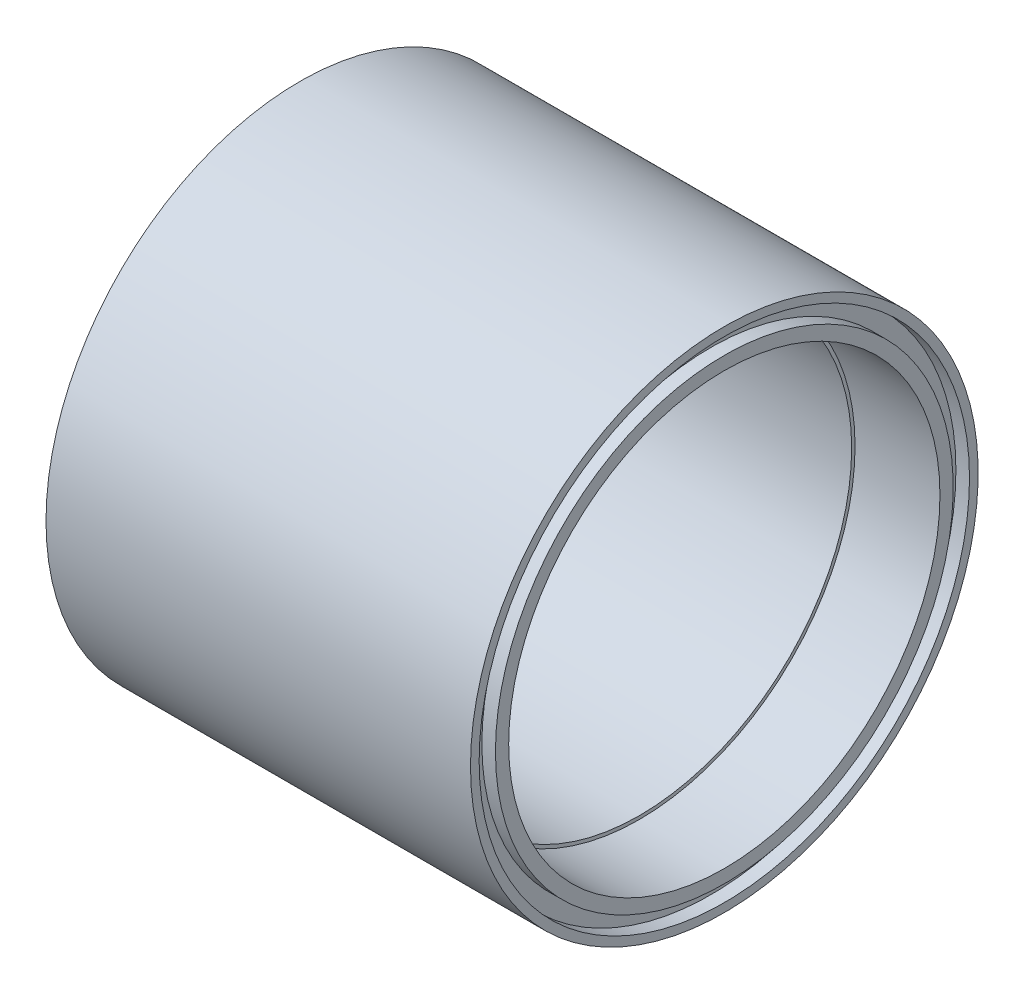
ISO-10303-21;
HEADER;
FILE_DESCRIPTION(('STEP AP214'),'2;1');
FILE_NAME('part.step','',(''),(''),'','','');
FILE_SCHEMA(('AUTOMOTIVE_DESIGN { 1 0 10303 214 1 1 1 1 }'));
ENDSEC;
DATA;
#1=APPLICATION_CONTEXT('core data for automotive mechanical design processes');
#2=APPLICATION_PROTOCOL_DEFINITION('international standard','automotive_design',2000,#1);
#3=PRODUCT_CONTEXT('',#1,'mechanical');
#4=PRODUCT('Part','Part','',(#3));
#5=PRODUCT_RELATED_PRODUCT_CATEGORY('part','',(#4));
#6=PRODUCT_DEFINITION_FORMATION('','',#4);
#7=PRODUCT_DEFINITION_CONTEXT('part definition',#1,'design');
#8=PRODUCT_DEFINITION('design','',#6,#7);
#9=PRODUCT_DEFINITION_SHAPE('','',#8);
#10=(LENGTH_UNIT() NAMED_UNIT(*) SI_UNIT(.MILLI.,.METRE.));
#11=(NAMED_UNIT(*) PLANE_ANGLE_UNIT() SI_UNIT($,.RADIAN.));
#12=(NAMED_UNIT(*) SI_UNIT($,.STERADIAN.) SOLID_ANGLE_UNIT());
#13=UNCERTAINTY_MEASURE_WITH_UNIT(LENGTH_MEASURE(1.E-05),#10,'distance_accuracy_value','');
#14=(GEOMETRIC_REPRESENTATION_CONTEXT(3) GLOBAL_UNCERTAINTY_ASSIGNED_CONTEXT((#13)) GLOBAL_UNIT_ASSIGNED_CONTEXT((#10,
#11,#12)) REPRESENTATION_CONTEXT('',''));
#15=CARTESIAN_POINT('',(0.,0.,0.));
#16=DIRECTION('',(0.,0.,1.));
#17=DIRECTION('',(1.,0.,0.));
#18=AXIS2_PLACEMENT_3D('',#15,#16,#17);
#19=CARTESIAN_POINT('',(31.75,32.258,0.));
#20=DIRECTION('',(-1.,0.,0.));
#21=DIRECTION('',(0.,0.,1.));
#22=AXIS2_PLACEMENT_3D('',#19,#20,#21);
#23=PLANE('',#22);
#24=CARTESIAN_POINT('',(31.75,0.,0.));
#25=DIRECTION('',(-1.,0.,0.));
#26=DIRECTION('',(0.,0.,1.));
#27=AXIS2_PLACEMENT_3D('',#24,#25,#26);
#28=CIRCLE('',#27,32.258);
#29=CARTESIAN_POINT('',(31.75,0.,32.258));
#30=VERTEX_POINT('',#29);
#31=EDGE_CURVE('E49',#30,#30,#28,.T.);
#32=ORIENTED_EDGE('',*,*,#31,.T.);
#33=EDGE_LOOP('',(#32));
#34=FACE_BOUND('',#33,.T.);
#35=CARTESIAN_POINT('',(31.75,0.,0.));
#36=DIRECTION('',(-1.,0.,0.));
#37=DIRECTION('',(0.,0.,1.));
#38=AXIS2_PLACEMENT_3D('',#35,#36,#37);
#39=CIRCLE('',#38,34.2392);
#40=CARTESIAN_POINT('',(31.75,0.,34.2392));
#41=VERTEX_POINT('',#40);
#42=EDGE_CURVE('E85',#41,#41,#39,.T.);
#43=ORIENTED_EDGE('',*,*,#42,.F.);
#44=EDGE_LOOP('',(#43));
#45=FACE_BOUND('',#44,.T.);
#46=ADVANCED_FACE('F34',(#34,#45),#23,.F.);
#47=CARTESIAN_POINT('',(-31.75,37.973,0.));
#48=DIRECTION('',(1.,0.,0.));
#49=DIRECTION('',(0.,0.,-1.));
#50=AXIS2_PLACEMENT_3D('',#47,#48,#49);
#51=PLANE('',#50);
#52=CARTESIAN_POINT('',(-31.75,0.,0.));
#53=DIRECTION('',(-1.,0.,0.));
#54=DIRECTION('',(0.,0.,1.));
#55=AXIS2_PLACEMENT_3D('',#52,#53,#54);
#56=CIRCLE('',#55,32.258);
#57=CARTESIAN_POINT('',(-31.75,0.,32.258));
#58=VERTEX_POINT('',#57);
#59=EDGE_CURVE('E10',#58,#58,#56,.T.);
#60=ORIENTED_EDGE('',*,*,#59,.F.);
#61=EDGE_LOOP('',(#60));
#62=FACE_BOUND('',#61,.T.);
#63=CARTESIAN_POINT('',(-31.75,0.,0.));
#64=DIRECTION('',(-1.,0.,0.));
#65=DIRECTION('',(0.,0.,1.));
#66=AXIS2_PLACEMENT_3D('',#63,#64,#65);
#67=CIRCLE('',#66,34.2392);
#68=CARTESIAN_POINT('',(-31.75,0.,34.2392));
#69=VERTEX_POINT('',#68);
#70=EDGE_CURVE('E73',#69,#69,#67,.T.);
#71=ORIENTED_EDGE('',*,*,#70,.T.);
#72=EDGE_LOOP('',(#71));
#73=FACE_BOUND('',#72,.T.);
#74=ADVANCED_FACE('F101',(#62,#73),#51,.F.);
#75=CARTESIAN_POINT('',(0.,0.,0.));
#76=DIRECTION('',(-1.,0.,0.));
#77=DIRECTION('',(0.,0.,1.));
#78=AXIS2_PLACEMENT_3D('',#75,#76,#77);
#79=CYLINDRICAL_SURFACE('',#78,32.258);
#80=CARTESIAN_POINT('',(-19.05,0.,0.));
#81=DIRECTION('',(-1.,0.,0.));
#82=DIRECTION('',(0.,0.,1.));
#83=AXIS2_PLACEMENT_3D('',#80,#81,#82);
#84=CIRCLE('',#83,32.258);
#85=CARTESIAN_POINT('',(-19.05,0.,32.258));
#86=VERTEX_POINT('',#85);
#87=EDGE_CURVE('E63',#86,#86,#84,.T.);
#88=ORIENTED_EDGE('',*,*,#87,.F.);
#89=EDGE_LOOP('',(#88));
#90=FACE_BOUND('',#89,.T.);
#91=ORIENTED_EDGE('',*,*,#59,.T.);
#92=EDGE_LOOP('',(#91));
#93=FACE_BOUND('',#92,.T.);
#94=ADVANCED_FACE('F36',(#90,#93),#79,.F.);
#95=CARTESIAN_POINT('',(-31.75,0.,0.));
#96=DIRECTION('',(-1.,0.,0.));
#97=DIRECTION('',(0.,0.,1.));
#98=AXIS2_PLACEMENT_3D('',#95,#96,#97);
#99=CIRCLE('',#98,36.6776);
#100=CARTESIAN_POINT('',(-31.75,0.,36.6776));
#101=VERTEX_POINT('',#100);
#102=EDGE_CURVE('E67',#101,#101,#99,.T.);
#103=ORIENTED_EDGE('',*,*,#102,.F.);
#104=EDGE_LOOP('',(#103));
#105=FACE_BOUND('',#104,.T.);
#106=CARTESIAN_POINT('',(-31.75,0.,0.));
#107=DIRECTION('',(-1.,0.,0.));
#108=DIRECTION('',(0.,0.,1.));
#109=AXIS2_PLACEMENT_3D('',#106,#107,#108);
#110=CIRCLE('',#109,37.973);
#111=CARTESIAN_POINT('',(-31.75,0.,37.973));
#112=VERTEX_POINT('',#111);
#113=EDGE_CURVE('E41',#112,#112,#110,.T.);
#114=ORIENTED_EDGE('',*,*,#113,.T.);
#115=EDGE_LOOP('',(#114));
#116=FACE_BOUND('',#115,.T.);
#117=ADVANCED_FACE('F109',(#105,#116),#51,.F.);
#118=CARTESIAN_POINT('',(0.,0.,0.));
#119=DIRECTION('',(-1.,0.,0.));
#120=DIRECTION('',(0.,0.,1.));
#121=AXIS2_PLACEMENT_3D('',#118,#119,#120);
#122=CYLINDRICAL_SURFACE('',#121,37.973);
#123=ORIENTED_EDGE('',*,*,#113,.F.);
#124=EDGE_LOOP('',(#123));
#125=FACE_BOUND('',#124,.T.);
#126=CARTESIAN_POINT('',(31.75,0.,0.));
#127=DIRECTION('',(-1.,0.,0.));
#128=DIRECTION('',(0.,0.,1.));
#129=AXIS2_PLACEMENT_3D('',#126,#127,#128);
#130=CIRCLE('',#129,37.973);
#131=CARTESIAN_POINT('',(31.75,0.,37.973));
#132=VERTEX_POINT('',#131);
#133=EDGE_CURVE('E45',#132,#132,#130,.T.);
#134=ORIENTED_EDGE('',*,*,#133,.T.);
#135=EDGE_LOOP('',(#134));
#136=FACE_BOUND('',#135,.T.);
#137=ADVANCED_FACE('F114',(#125,#136),#122,.T.);
#138=CARTESIAN_POINT('',(31.75,0.,0.));
#139=DIRECTION('',(-1.,0.,0.));
#140=DIRECTION('',(0.,0.,1.));
#141=AXIS2_PLACEMENT_3D('',#138,#139,#140);
#142=CIRCLE('',#141,36.6776);
#143=CARTESIAN_POINT('',(31.75,0.,36.6776));
#144=VERTEX_POINT('',#143);
#145=EDGE_CURVE('E79',#144,#144,#142,.T.);
#146=ORIENTED_EDGE('',*,*,#145,.T.);
#147=EDGE_LOOP('',(#146));
#148=FACE_BOUND('',#147,.T.);
#149=ORIENTED_EDGE('',*,*,#133,.F.);
#150=EDGE_LOOP('',(#149));
#151=FACE_BOUND('',#150,.T.);
#152=ADVANCED_FACE('F104',(#148,#151),#23,.F.);
#153=CARTESIAN_POINT('',(0.,0.,0.));
#154=DIRECTION('',(-1.,0.,0.));
#155=DIRECTION('',(0.,0.,1.));
#156=AXIS2_PLACEMENT_3D('',#153,#154,#155);
#157=CYLINDRICAL_SURFACE('',#156,32.258);
#158=ORIENTED_EDGE('',*,*,#31,.F.);
#159=EDGE_LOOP('',(#158));
#160=FACE_BOUND('',#159,.T.);
#161=CARTESIAN_POINT('',(19.05,0.,0.));
#162=DIRECTION('',(-1.,0.,0.));
#163=DIRECTION('',(0.,0.,1.));
#164=AXIS2_PLACEMENT_3D('',#161,#162,#163);
#165=CIRCLE('',#164,32.258);
#166=CARTESIAN_POINT('',(19.05,0.,32.258));
#167=VERTEX_POINT('',#166);
#168=EDGE_CURVE('E54',#167,#167,#165,.T.);
#169=ORIENTED_EDGE('',*,*,#168,.T.);
#170=EDGE_LOOP('',(#169));
#171=FACE_BOUND('',#170,.T.);
#172=ADVANCED_FACE('F113',(#160,#171),#157,.F.);
#173=CARTESIAN_POINT('',(19.05,31.75,0.));
#174=DIRECTION('',(-1.,0.,0.));
#175=DIRECTION('',(0.,0.,1.));
#176=AXIS2_PLACEMENT_3D('',#173,#174,#175);
#177=PLANE('',#176);
#178=ORIENTED_EDGE('',*,*,#168,.F.);
#179=EDGE_LOOP('',(#178));
#180=FACE_BOUND('',#179,.T.);
#181=CARTESIAN_POINT('',(19.05,0.,0.));
#182=DIRECTION('',(-1.,0.,0.));
#183=DIRECTION('',(0.,0.,1.));
#184=AXIS2_PLACEMENT_3D('',#181,#182,#183);
#185=CIRCLE('',#184,31.75);
#186=CARTESIAN_POINT('',(19.05,0.,31.75));
#187=VERTEX_POINT('',#186);
#188=EDGE_CURVE('E57',#187,#187,#185,.T.);
#189=ORIENTED_EDGE('',*,*,#188,.T.);
#190=EDGE_LOOP('',(#189));
#191=FACE_BOUND('',#190,.T.);
#192=ADVANCED_FACE('F120',(#180,#191),#177,.F.);
#193=CARTESIAN_POINT('',(0.,0.,0.));
#194=DIRECTION('',(-1.,0.,0.));
#195=DIRECTION('',(0.,0.,1.));
#196=AXIS2_PLACEMENT_3D('',#193,#194,#195);
#197=CYLINDRICAL_SURFACE('',#196,31.75);
#198=ORIENTED_EDGE('',*,*,#188,.F.);
#199=EDGE_LOOP('',(#198));
#200=FACE_BOUND('',#199,.T.);
#201=CARTESIAN_POINT('',(-19.05,0.,0.));
#202=DIRECTION('',(-1.,0.,0.));
#203=DIRECTION('',(0.,0.,1.));
#204=AXIS2_PLACEMENT_3D('',#201,#202,#203);
#205=CIRCLE('',#204,31.75);
#206=CARTESIAN_POINT('',(-19.05,0.,31.75));
#207=VERTEX_POINT('',#206);
#208=EDGE_CURVE('E60',#207,#207,#205,.T.);
#209=ORIENTED_EDGE('',*,*,#208,.T.);
#210=EDGE_LOOP('',(#209));
#211=FACE_BOUND('',#210,.T.);
#212=ADVANCED_FACE('F152',(#200,#211),#197,.F.);
#213=CARTESIAN_POINT('',(-19.05,32.258,0.));
#214=DIRECTION('',(1.,0.,0.));
#215=DIRECTION('',(0.,0.,-1.));
#216=AXIS2_PLACEMENT_3D('',#213,#214,#215);
#217=PLANE('',#216);
#218=ORIENTED_EDGE('',*,*,#208,.F.);
#219=EDGE_LOOP('',(#218));
#220=FACE_BOUND('',#219,.T.);
#221=ORIENTED_EDGE('',*,*,#87,.T.);
#222=EDGE_LOOP('',(#221));
#223=FACE_BOUND('',#222,.T.);
#224=ADVANCED_FACE('F148',(#220,#223),#217,.F.);
#225=CARTESIAN_POINT('',(-29.718,0.,0.));
#226=DIRECTION('',(-1.,0.,0.));
#227=DIRECTION('',(0.,0.,1.));
#228=AXIS2_PLACEMENT_3D('',#225,#226,#227);
#229=CYLINDRICAL_SURFACE('',#228,36.6776);
#230=CARTESIAN_POINT('',(-29.718,0.,0.));
#231=DIRECTION('',(-1.,0.,0.));
#232=DIRECTION('',(0.,0.,1.));
#233=AXIS2_PLACEMENT_3D('',#230,#231,#232);
#234=CIRCLE('',#233,36.6776);
#235=CARTESIAN_POINT('',(-29.718,0.,36.6776));
#236=VERTEX_POINT('',#235);
#237=EDGE_CURVE('E66',#236,#236,#234,.T.);
#238=ORIENTED_EDGE('',*,*,#237,.F.);
#239=EDGE_LOOP('',(#238));
#240=FACE_BOUND('',#239,.T.);
#241=ORIENTED_EDGE('',*,*,#102,.T.);
#242=EDGE_LOOP('',(#241));
#243=FACE_BOUND('',#242,.T.);
#244=ADVANCED_FACE('F144',(#240,#243),#229,.F.);
#245=CARTESIAN_POINT('',(-29.718,0.,0.));
#246=DIRECTION('',(-1.,0.,0.));
#247=DIRECTION('',(0.,0.,1.));
#248=AXIS2_PLACEMENT_3D('',#245,#246,#247);
#249=PLANE('',#248);
#250=CARTESIAN_POINT('',(-29.718,0.,0.));
#251=DIRECTION('',(-1.,0.,0.));
#252=DIRECTION('',(0.,0.,1.));
#253=AXIS2_PLACEMENT_3D('',#250,#251,#252);
#254=CIRCLE('',#253,34.2392);
#255=CARTESIAN_POINT('',(-29.718,0.,34.2392));
#256=VERTEX_POINT('',#255);
#257=EDGE_CURVE('E70',#256,#256,#254,.T.);
#258=ORIENTED_EDGE('',*,*,#257,.F.);
#259=EDGE_LOOP('',(#258));
#260=FACE_BOUND('',#259,.T.);
#261=ORIENTED_EDGE('',*,*,#237,.T.);
#262=EDGE_LOOP('',(#261));
#263=FACE_BOUND('',#262,.T.);
#264=ADVANCED_FACE('F140',(#260,#263),#249,.T.);
#265=CARTESIAN_POINT('',(-29.718,0.,0.));
#266=DIRECTION('',(-1.,0.,0.));
#267=DIRECTION('',(0.,0.,1.));
#268=AXIS2_PLACEMENT_3D('',#265,#266,#267);
#269=CYLINDRICAL_SURFACE('',#268,34.2392);
#270=ORIENTED_EDGE('',*,*,#257,.T.);
#271=EDGE_LOOP('',(#270));
#272=FACE_BOUND('',#271,.T.);
#273=ORIENTED_EDGE('',*,*,#70,.F.);
#274=EDGE_LOOP('',(#273));
#275=FACE_BOUND('',#274,.T.);
#276=ADVANCED_FACE('F134',(#272,#275),#269,.T.);
#277=CARTESIAN_POINT('',(29.718,0.,0.));
#278=DIRECTION('',(1.,0.,0.));
#279=DIRECTION('',(0.,0.,1.));
#280=AXIS2_PLACEMENT_3D('',#277,#278,#279);
#281=PLANE('',#280);
#282=CARTESIAN_POINT('',(29.718,0.,0.));
#283=DIRECTION('',(-1.,0.,0.));
#284=DIRECTION('',(0.,0.,1.));
#285=AXIS2_PLACEMENT_3D('',#282,#283,#284);
#286=CIRCLE('',#285,36.6776);
#287=CARTESIAN_POINT('',(29.718,0.,36.6776));
#288=VERTEX_POINT('',#287);
#289=EDGE_CURVE('E76',#288,#288,#286,.T.);
#290=ORIENTED_EDGE('',*,*,#289,.F.);
#291=EDGE_LOOP('',(#290));
#292=FACE_BOUND('',#291,.T.);
#293=CARTESIAN_POINT('',(29.718,0.,0.));
#294=DIRECTION('',(-1.,0.,0.));
#295=DIRECTION('',(0.,0.,1.));
#296=AXIS2_PLACEMENT_3D('',#293,#294,#295);
#297=CIRCLE('',#296,34.2392);
#298=CARTESIAN_POINT('',(29.718,0.,34.2392));
#299=VERTEX_POINT('',#298);
#300=EDGE_CURVE('E82',#299,#299,#297,.T.);
#301=ORIENTED_EDGE('',*,*,#300,.T.);
#302=EDGE_LOOP('',(#301));
#303=FACE_BOUND('',#302,.T.);
#304=ADVANCED_FACE('F91',(#292,#303),#281,.T.);
#305=CARTESIAN_POINT('',(29.718,0.,0.));
#306=DIRECTION('',(1.,0.,0.));
#307=DIRECTION('',(0.,0.,-1.));
#308=AXIS2_PLACEMENT_3D('',#305,#306,#307);
#309=CYLINDRICAL_SURFACE('',#308,36.6776);
#310=ORIENTED_EDGE('',*,*,#289,.T.);
#311=EDGE_LOOP('',(#310));
#312=FACE_BOUND('',#311,.T.);
#313=ORIENTED_EDGE('',*,*,#145,.F.);
#314=EDGE_LOOP('',(#313));
#315=FACE_BOUND('',#314,.T.);
#316=ADVANCED_FACE('F96',(#312,#315),#309,.F.);
#317=CARTESIAN_POINT('',(29.718,0.,0.));
#318=DIRECTION('',(1.,0.,0.));
#319=DIRECTION('',(0.,0.,-1.));
#320=AXIS2_PLACEMENT_3D('',#317,#318,#319);
#321=CYLINDRICAL_SURFACE('',#320,34.2392);
#322=ORIENTED_EDGE('',*,*,#300,.F.);
#323=EDGE_LOOP('',(#322));
#324=FACE_BOUND('',#323,.T.);
#325=ORIENTED_EDGE('',*,*,#42,.T.);
#326=EDGE_LOOP('',(#325));
#327=FACE_BOUND('',#326,.T.);
#328=ADVANCED_FACE('F93',(#324,#327),#321,.T.);
#329=CLOSED_SHELL('',(#46,#74,#94,#117,#137,#152,#172,#192,#212,#224,#244,#264,#276,#304,#316,#328));
#330=MANIFOLD_SOLID_BREP('B2',#329);
#331=ADVANCED_BREP_SHAPE_REPRESENTATION('',(#18,#330),#14);
#332=SHAPE_DEFINITION_REPRESENTATION(#9,#331);
ENDSEC;
END-ISO-10303-21;
